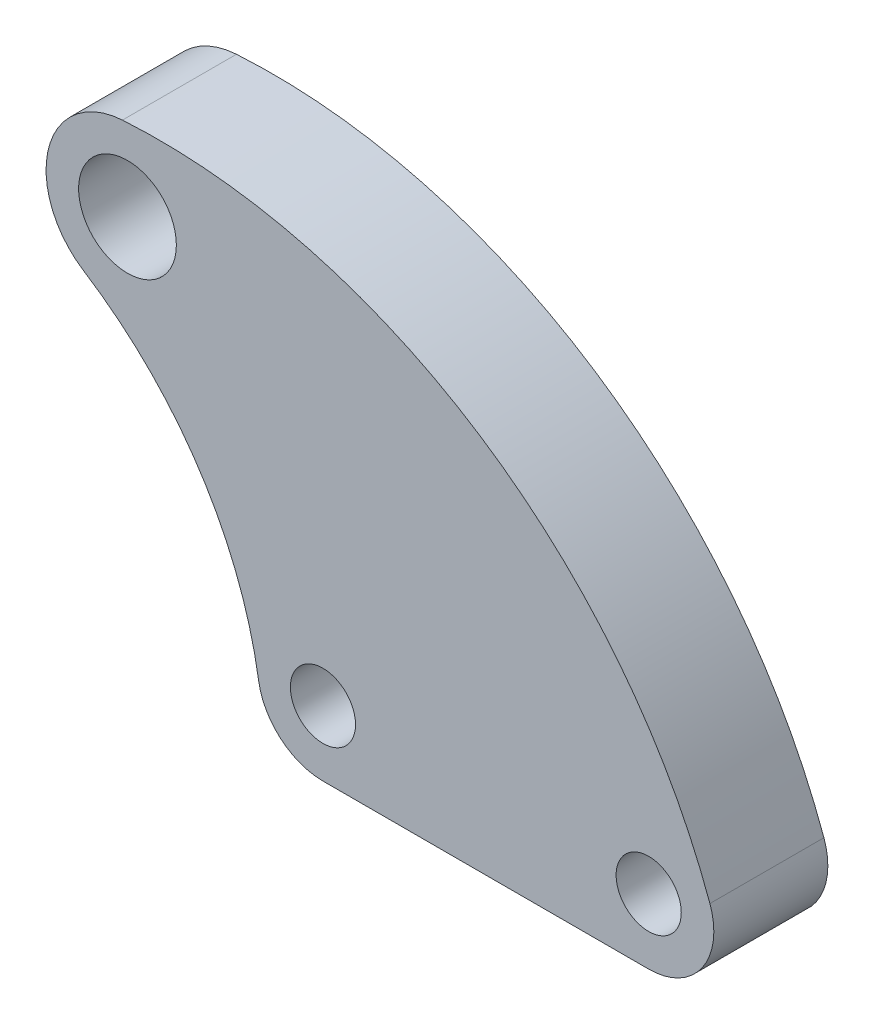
from build123d import *

# Parameters (mm, degrees)
SKETCH1_R           = 10
SKETCH1_R_2         = 15
BOSS_EXTRUDE1_DEPTH = 17.5


with BuildPart() as part:
    # Sketch1 → Boss-Extrude1 (new, symmetric)
    with BuildSketch(Plane.XY):
        with BuildLine():
            Line((0, -20), (100, -20))
            ThreePointArc((100, -20), (116.382150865, -11.472799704), (118.794913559, 6.837486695))
            ThreePointArc((118.794913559, 6.837486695), (48.258458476, 95.88076935), (-61.554950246, 124.951595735))
            ThreePointArc((-61.554950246, 124.951595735), (-84.1985694, 106.27927058), (-73.491169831, 78.952711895))
            ThreePointArc((-73.491169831, 78.952711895), (-37.844108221, 43.644074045), (-19.749826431, -3.153467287))
            ThreePointArc((-19.749826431, -3.153467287), (-12.979419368, -15.216263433), (0, -20))
        make_face()
        Circle(SKETCH1_R, mode=Mode.SUBTRACT)
        with Locations((100, 0)):
            Circle(SKETCH1_R, mode=Mode.SUBTRACT)
        with Locations((-60, 100)):
            Circle(SKETCH1_R_2, mode=Mode.SUBTRACT)
    extrude(amount=BOSS_EXTRUDE1_DEPTH, both=True)


solid = part.part
